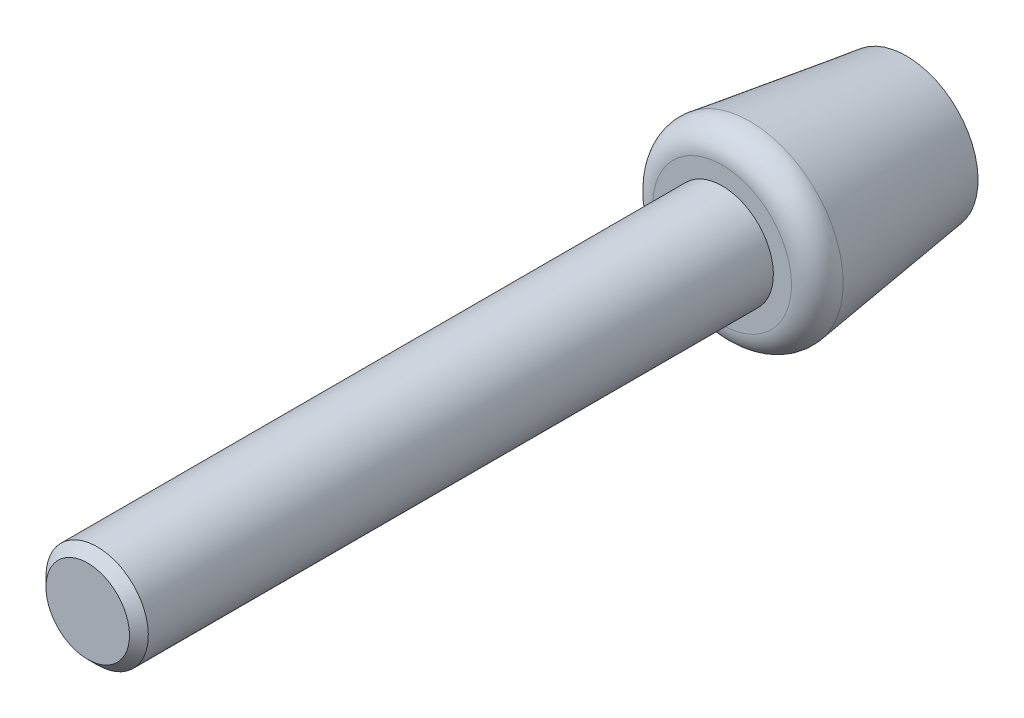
ISO-10303-21;
HEADER;
FILE_DESCRIPTION(('STEP AP214'),'2;1');
FILE_NAME('part.step','',(''),(''),'','','');
FILE_SCHEMA(('AUTOMOTIVE_DESIGN { 1 0 10303 214 1 1 1 1 }'));
ENDSEC;
DATA;
#1=APPLICATION_CONTEXT('core data for automotive mechanical design processes');
#2=APPLICATION_PROTOCOL_DEFINITION('international standard','automotive_design',2000,#1);
#3=PRODUCT_CONTEXT('',#1,'mechanical');
#4=PRODUCT('Part','Part','',(#3));
#5=PRODUCT_RELATED_PRODUCT_CATEGORY('part','',(#4));
#6=PRODUCT_DEFINITION_FORMATION('','',#4);
#7=PRODUCT_DEFINITION_CONTEXT('part definition',#1,'design');
#8=PRODUCT_DEFINITION('design','',#6,#7);
#9=PRODUCT_DEFINITION_SHAPE('','',#8);
#10=(LENGTH_UNIT() NAMED_UNIT(*) SI_UNIT(.MILLI.,.METRE.));
#11=(NAMED_UNIT(*) PLANE_ANGLE_UNIT() SI_UNIT($,.RADIAN.));
#12=(NAMED_UNIT(*) SI_UNIT($,.STERADIAN.) SOLID_ANGLE_UNIT());
#13=UNCERTAINTY_MEASURE_WITH_UNIT(LENGTH_MEASURE(1.E-05),#10,'distance_accuracy_value','');
#14=(GEOMETRIC_REPRESENTATION_CONTEXT(3) GLOBAL_UNCERTAINTY_ASSIGNED_CONTEXT((#13)) GLOBAL_UNIT_ASSIGNED_CONTEXT((#10,
#11,#12)) REPRESENTATION_CONTEXT('',''));
#15=CARTESIAN_POINT('',(0.,0.,0.));
#16=DIRECTION('',(0.,0.,1.));
#17=DIRECTION('',(1.,0.,0.));
#18=AXIS2_PLACEMENT_3D('',#15,#16,#17);
#19=CARTESIAN_POINT('',(0.,0.,80.));
#20=DIRECTION('',(0.,0.,1.));
#21=DIRECTION('',(0.,-1.,0.));
#22=AXIS2_PLACEMENT_3D('',#19,#20,#21);
#23=PLANE('',#22);
#24=CARTESIAN_POINT('',(0.,0.,80.));
#25=DIRECTION('',(0.,0.,1.));
#26=DIRECTION('',(0.,-1.,0.));
#27=AXIS2_PLACEMENT_3D('',#24,#25,#26);
#28=CIRCLE('',#27,4.08);
#29=CARTESIAN_POINT('',(0.,-4.08,80.));
#30=VERTEX_POINT('',#29);
#31=EDGE_CURVE('E8',#30,#30,#28,.T.);
#32=ORIENTED_EDGE('',*,*,#31,.T.);
#33=EDGE_LOOP('',(#32));
#34=FACE_BOUND('',#33,.T.);
#35=ADVANCED_FACE('F13',(#34),#23,.T.);
#36=CARTESIAN_POINT('',(0.,0.,80.));
#37=DIRECTION('',(0.,0.,-1.));
#38=DIRECTION('',(0.,1.,0.));
#39=AXIS2_PLACEMENT_3D('',#36,#37,#38);
#40=CONICAL_SURFACE('',#39,4.08,0.785398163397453);
#41=CARTESIAN_POINT('',(0.,0.,79.08));
#42=DIRECTION('',(0.,0.,1.));
#43=DIRECTION('',(0.,-1.,0.));
#44=AXIS2_PLACEMENT_3D('',#41,#42,#43);
#45=CIRCLE('',#44,5.);
#46=CARTESIAN_POINT('',(0.,-5.,79.08));
#47=VERTEX_POINT('',#46);
#48=EDGE_CURVE('E19',#47,#47,#45,.T.);
#49=ORIENTED_EDGE('',*,*,#48,.T.);
#50=EDGE_LOOP('',(#49));
#51=FACE_BOUND('',#50,.T.);
#52=ORIENTED_EDGE('',*,*,#31,.F.);
#53=EDGE_LOOP('',(#52));
#54=FACE_BOUND('',#53,.T.);
#55=ADVANCED_FACE('F53',(#51,#54),#40,.T.);
#56=CARTESIAN_POINT('',(0.,0.,0.));
#57=DIRECTION('',(0.,0.,1.));
#58=DIRECTION('',(0.,-1.,0.));
#59=AXIS2_PLACEMENT_3D('',#56,#57,#58);
#60=CYLINDRICAL_SURFACE('',#59,5.);
#61=CARTESIAN_POINT('',(0.,0.,18.));
#62=DIRECTION('',(0.,0.,1.));
#63=DIRECTION('',(0.,-1.,0.));
#64=AXIS2_PLACEMENT_3D('',#61,#62,#63);
#65=CIRCLE('',#64,5.);
#66=CARTESIAN_POINT('',(0.,-5.,18.));
#67=VERTEX_POINT('',#66);
#68=EDGE_CURVE('E23',#67,#67,#65,.T.);
#69=ORIENTED_EDGE('',*,*,#68,.T.);
#70=EDGE_LOOP('',(#69));
#71=FACE_BOUND('',#70,.T.);
#72=ORIENTED_EDGE('',*,*,#48,.F.);
#73=EDGE_LOOP('',(#72));
#74=FACE_BOUND('',#73,.T.);
#75=ADVANCED_FACE('F58',(#71,#74),#60,.T.);
#76=CARTESIAN_POINT('',(5.,0.,18.));
#77=DIRECTION('',(0.,0.,1.));
#78=DIRECTION('',(0.,-1.,0.));
#79=AXIS2_PLACEMENT_3D('',#76,#77,#78);
#80=PLANE('',#79);
#81=CARTESIAN_POINT('',(0.,0.,18.));
#82=DIRECTION('',(0.,0.,1.));
#83=DIRECTION('',(0.,-1.,0.));
#84=AXIS2_PLACEMENT_3D('',#81,#82,#83);
#85=CIRCLE('',#84,6.7723412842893);
#86=CARTESIAN_POINT('',(0.,-6.7723412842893,18.));
#87=VERTEX_POINT('',#86);
#88=EDGE_CURVE('E27',#87,#87,#85,.T.);
#89=ORIENTED_EDGE('',*,*,#88,.T.);
#90=EDGE_LOOP('',(#89));
#91=FACE_BOUND('',#90,.T.);
#92=ORIENTED_EDGE('',*,*,#68,.F.);
#93=EDGE_LOOP('',(#92));
#94=FACE_BOUND('',#93,.T.);
#95=ADVANCED_FACE('F63',(#91,#94),#80,.T.);
#96=CARTESIAN_POINT('',(0.,0.,15.625));
#97=DIRECTION('',(0.,0.,1.));
#98=DIRECTION('',(0.,-1.,0.));
#99=AXIS2_PLACEMENT_3D('',#96,#97,#98);
#100=TOROIDAL_SURFACE('',#99,6.77234128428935,2.375);
#101=CARTESIAN_POINT('',(0.,0.,15.2982751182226));
#102=DIRECTION('',(0.,0.,1.));
#103=DIRECTION('',(0.,-1.,0.));
#104=AXIS2_PLACEMENT_3D('',#101,#102,#103);
#105=CIRCLE('',#104,9.1247604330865);
#106=CARTESIAN_POINT('',(0.,-9.1247604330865,15.2982751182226));
#107=VERTEX_POINT('',#106);
#108=EDGE_CURVE('E32',#107,#107,#105,.T.);
#109=ORIENTED_EDGE('',*,*,#108,.T.);
#110=EDGE_LOOP('',(#109));
#111=FACE_BOUND('',#110,.T.);
#112=ORIENTED_EDGE('',*,*,#88,.F.);
#113=EDGE_LOOP('',(#112));
#114=FACE_BOUND('',#113,.T.);
#115=ADVANCED_FACE('F50',(#111,#114),#100,.T.);
#116=CARTESIAN_POINT('',(0.,0.,15.2982751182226));
#117=DIRECTION('',(0.,0.,1.));
#118=DIRECTION('',(0.,-1.,0.));
#119=AXIS2_PLACEMENT_3D('',#116,#117,#118);
#120=CONICAL_SURFACE('',#119,9.1247604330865,0.138006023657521);
#121=CARTESIAN_POINT('',(0.,0.,0.));
#122=DIRECTION('',(0.,0.,1.));
#123=DIRECTION('',(0.,-1.,0.));
#124=AXIS2_PLACEMENT_3D('',#121,#122,#123);
#125=CIRCLE('',#124,7.);
#126=CARTESIAN_POINT('',(0.,-7.,0.));
#127=VERTEX_POINT('',#126);
#128=EDGE_CURVE('E35',#127,#127,#125,.T.);
#129=ORIENTED_EDGE('',*,*,#128,.T.);
#130=EDGE_LOOP('',(#129));
#131=FACE_BOUND('',#130,.T.);
#132=ORIENTED_EDGE('',*,*,#108,.F.);
#133=EDGE_LOOP('',(#132));
#134=FACE_BOUND('',#133,.T.);
#135=ADVANCED_FACE('F39',(#131,#134),#120,.T.);
#136=CARTESIAN_POINT('',(7.,0.,0.));
#137=DIRECTION('',(0.,0.,-1.));
#138=DIRECTION('',(0.,1.,0.));
#139=AXIS2_PLACEMENT_3D('',#136,#137,#138);
#140=PLANE('',#139);
#141=ORIENTED_EDGE('',*,*,#128,.F.);
#142=EDGE_LOOP('',(#141));
#143=FACE_BOUND('',#142,.T.);
#144=ADVANCED_FACE('F42',(#143),#140,.T.);
#145=CLOSED_SHELL('',(#35,#55,#75,#95,#115,#135,#144));
#146=MANIFOLD_SOLID_BREP('B1',#145);
#147=ADVANCED_BREP_SHAPE_REPRESENTATION('',(#18,#146),#14);
#148=SHAPE_DEFINITION_REPRESENTATION(#9,#147);
ENDSEC;
END-ISO-10303-21;
